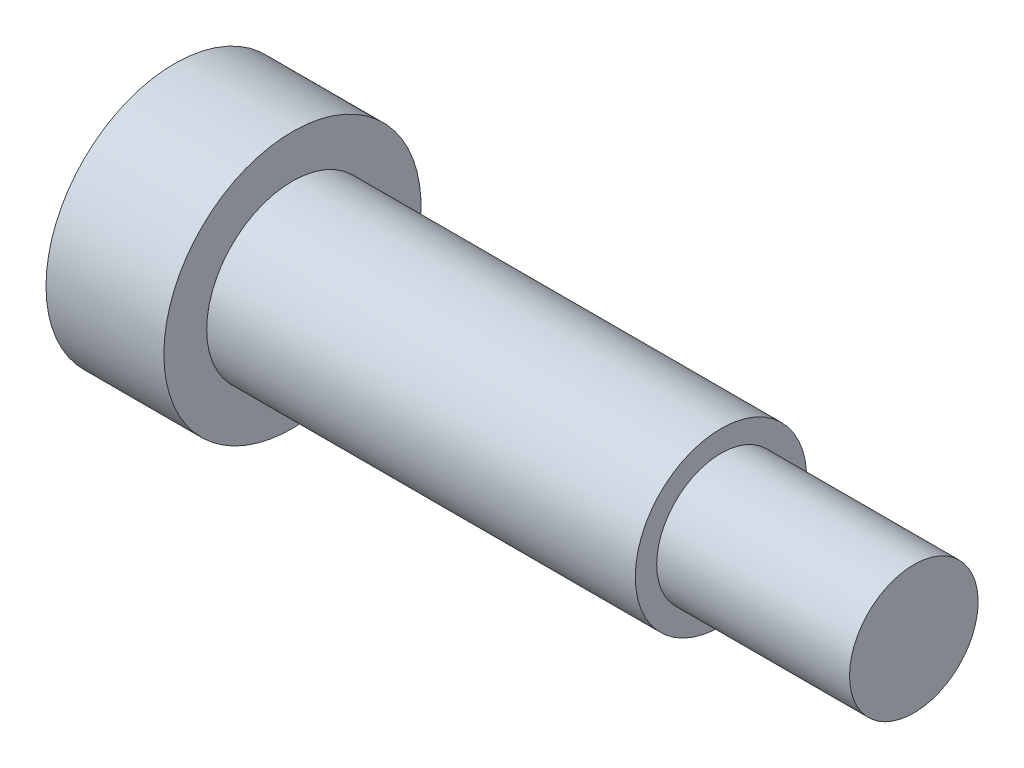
ISO-10303-21;
HEADER;
FILE_DESCRIPTION(('STEP AP214'),'2;1');
FILE_NAME('part.step','',(''),(''),'','','');
FILE_SCHEMA(('AUTOMOTIVE_DESIGN { 1 0 10303 214 1 1 1 1 }'));
ENDSEC;
DATA;
#1=APPLICATION_CONTEXT('core data for automotive mechanical design processes');
#2=APPLICATION_PROTOCOL_DEFINITION('international standard','automotive_design',2000,#1);
#3=PRODUCT_CONTEXT('',#1,'mechanical');
#4=PRODUCT('Part','Part','',(#3));
#5=PRODUCT_RELATED_PRODUCT_CATEGORY('part','',(#4));
#6=PRODUCT_DEFINITION_FORMATION('','',#4);
#7=PRODUCT_DEFINITION_CONTEXT('part definition',#1,'design');
#8=PRODUCT_DEFINITION('design','',#6,#7);
#9=PRODUCT_DEFINITION_SHAPE('','',#8);
#10=(LENGTH_UNIT() NAMED_UNIT(*) SI_UNIT(.MILLI.,.METRE.));
#11=(NAMED_UNIT(*) PLANE_ANGLE_UNIT() SI_UNIT($,.RADIAN.));
#12=(NAMED_UNIT(*) SI_UNIT($,.STERADIAN.) SOLID_ANGLE_UNIT());
#13=UNCERTAINTY_MEASURE_WITH_UNIT(LENGTH_MEASURE(1.E-05),#10,'distance_accuracy_value','');
#14=(GEOMETRIC_REPRESENTATION_CONTEXT(3) GLOBAL_UNCERTAINTY_ASSIGNED_CONTEXT((#13)) GLOBAL_UNIT_ASSIGNED_CONTEXT((#10,
#11,#12)) REPRESENTATION_CONTEXT('',''));
#15=CARTESIAN_POINT('',(0.,0.,0.));
#16=DIRECTION('',(0.,0.,1.));
#17=DIRECTION('',(1.,0.,0.));
#18=AXIS2_PLACEMENT_3D('',#15,#16,#17);
#19=CARTESIAN_POINT('',(-5.,0.,4.61880215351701));
#20=DIRECTION('',(-1.,0.,0.));
#21=DIRECTION('',(0.,0.,1.));
#22=AXIS2_PLACEMENT_3D('',#19,#20,#21);
#23=PLANE('',#22);
#24=DIRECTION('',(0.,0.866025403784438,-0.5));
#25=VECTOR('',#24,1.);
#26=CARTESIAN_POINT('',(-5.,0.,-4.61880215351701));
#27=LINE('',#26,#25);
#28=CARTESIAN_POINT('',(-5.,0.,-4.61880215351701));
#29=VERTEX_POINT('',#28);
#30=CARTESIAN_POINT('',(-5.,-4.,-2.3094010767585));
#31=VERTEX_POINT('',#30);
#32=EDGE_CURVE('E90',#29,#31,#27,.F.);
#33=ORIENTED_EDGE('',*,*,#32,.T.);
#34=DIRECTION('',(0.,0.,-1.));
#35=VECTOR('',#34,1.);
#36=CARTESIAN_POINT('',(-5.,-4.,-2.3094010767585));
#37=LINE('',#36,#35);
#38=CARTESIAN_POINT('',(-5.,-4.,2.3094010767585));
#39=VERTEX_POINT('',#38);
#40=EDGE_CURVE('E132',#31,#39,#37,.F.);
#41=ORIENTED_EDGE('',*,*,#40,.T.);
#42=DIRECTION('',(0.,-0.866025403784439,-0.5));
#43=VECTOR('',#42,1.);
#44=CARTESIAN_POINT('',(-5.,-4.,2.3094010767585));
#45=LINE('',#44,#43);
#46=CARTESIAN_POINT('',(-5.,0.,4.61880215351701));
#47=VERTEX_POINT('',#46);
#48=EDGE_CURVE('E127',#39,#47,#45,.F.);
#49=ORIENTED_EDGE('',*,*,#48,.T.);
#50=DIRECTION('',(0.,-0.866025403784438,0.5));
#51=VECTOR('',#50,1.);
#52=CARTESIAN_POINT('',(-5.,0.,4.61880215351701));
#53=LINE('',#52,#51);
#54=CARTESIAN_POINT('',(-5.,4.,2.3094010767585));
#55=VERTEX_POINT('',#54);
#56=EDGE_CURVE('E73',#47,#55,#53,.F.);
#57=ORIENTED_EDGE('',*,*,#56,.T.);
#58=DIRECTION('',(0.,0.,1.));
#59=VECTOR('',#58,1.);
#60=CARTESIAN_POINT('',(-5.,4.,2.3094010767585));
#61=LINE('',#60,#59);
#62=CARTESIAN_POINT('',(-5.,4.,-2.3094010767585));
#63=VERTEX_POINT('',#62);
#64=EDGE_CURVE('E70',#55,#63,#61,.F.);
#65=ORIENTED_EDGE('',*,*,#64,.T.);
#66=DIRECTION('',(0.,0.866025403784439,0.5));
#67=VECTOR('',#66,1.);
#68=CARTESIAN_POINT('',(-5.,4.,-2.3094010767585));
#69=LINE('',#68,#67);
#70=EDGE_CURVE('E67',#63,#29,#69,.F.);
#71=ORIENTED_EDGE('',*,*,#70,.T.);
#72=EDGE_LOOP('',(#33,#41,#49,#57,#65,#71));
#73=FACE_BOUND('',#72,.T.);
#74=ADVANCED_FACE('F16',(#73),#23,.T.);
#75=CARTESIAN_POINT('',(-5.,4.,2.3094010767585));
#76=DIRECTION('',(0.,1.,0.));
#77=DIRECTION('',(0.,0.,1.));
#78=AXIS2_PLACEMENT_3D('',#75,#76,#77);
#79=PLANE('',#78);
#80=DIRECTION('',(1.,0.,0.));
#81=VECTOR('',#80,1.);
#82=CARTESIAN_POINT('',(-5.,4.,-2.3094010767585));
#83=LINE('',#82,#81);
#84=CARTESIAN_POINT('',(-11.,4.,-2.3094010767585));
#85=VERTEX_POINT('',#84);
#86=EDGE_CURVE('E76',#85,#63,#83,.T.);
#87=ORIENTED_EDGE('',*,*,#86,.T.);
#88=ORIENTED_EDGE('',*,*,#64,.F.);
#89=DIRECTION('',(1.,0.,0.));
#90=VECTOR('',#89,1.);
#91=CARTESIAN_POINT('',(-5.,4.,2.3094010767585));
#92=LINE('',#91,#90);
#93=CARTESIAN_POINT('',(-11.,4.,2.3094010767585));
#94=VERTEX_POINT('',#93);
#95=EDGE_CURVE('E122',#55,#94,#92,.F.);
#96=ORIENTED_EDGE('',*,*,#95,.T.);
#97=DIRECTION('',(0.,0.,-1.));
#98=VECTOR('',#97,1.);
#99=CARTESIAN_POINT('',(-11.,4.,0.));
#100=LINE('',#99,#98);
#101=EDGE_CURVE('E81',#94,#85,#100,.T.);
#102=ORIENTED_EDGE('',*,*,#101,.T.);
#103=EDGE_LOOP('',(#87,#88,#96,#102));
#104=FACE_BOUND('',#103,.T.);
#105=ADVANCED_FACE('F79',(#104),#79,.F.);
#106=CARTESIAN_POINT('',(-5.,4.,-2.3094010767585));
#107=DIRECTION('',(0.,0.5,-0.866025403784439));
#108=DIRECTION('',(0.,0.866025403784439,0.5));
#109=AXIS2_PLACEMENT_3D('',#106,#107,#108);
#110=PLANE('',#109);
#111=DIRECTION('',(1.,0.,0.));
#112=VECTOR('',#111,1.);
#113=CARTESIAN_POINT('',(-5.,0.,-4.61880215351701));
#114=LINE('',#113,#112);
#115=CARTESIAN_POINT('',(-11.,0.,-4.61880215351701));
#116=VERTEX_POINT('',#115);
#117=EDGE_CURVE('E87',#116,#29,#114,.T.);
#118=ORIENTED_EDGE('',*,*,#117,.T.);
#119=ORIENTED_EDGE('',*,*,#70,.F.);
#120=ORIENTED_EDGE('',*,*,#86,.F.);
#121=DIRECTION('',(0.,-0.866025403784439,-0.5));
#122=VECTOR('',#121,1.);
#123=CARTESIAN_POINT('',(-11.,4.,-2.3094010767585));
#124=LINE('',#123,#122);
#125=EDGE_CURVE('E119',#85,#116,#124,.T.);
#126=ORIENTED_EDGE('',*,*,#125,.T.);
#127=EDGE_LOOP('',(#118,#119,#120,#126));
#128=FACE_BOUND('',#127,.T.);
#129=ADVANCED_FACE('F85',(#128),#110,.F.);
#130=CARTESIAN_POINT('',(-5.,0.,-4.61880215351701));
#131=DIRECTION('',(0.,-0.5,-0.866025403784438));
#132=DIRECTION('',(0.,0.866025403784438,-0.5));
#133=AXIS2_PLACEMENT_3D('',#130,#131,#132);
#134=PLANE('',#133);
#135=DIRECTION('',(1.,0.,0.));
#136=VECTOR('',#135,1.);
#137=CARTESIAN_POINT('',(-5.,-4.,-2.3094010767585));
#138=LINE('',#137,#136);
#139=CARTESIAN_POINT('',(-11.,-4.,-2.3094010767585));
#140=VERTEX_POINT('',#139);
#141=EDGE_CURVE('E134',#140,#31,#138,.T.);
#142=ORIENTED_EDGE('',*,*,#141,.T.);
#143=ORIENTED_EDGE('',*,*,#32,.F.);
#144=ORIENTED_EDGE('',*,*,#117,.F.);
#145=DIRECTION('',(0.,-0.866025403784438,0.5));
#146=VECTOR('',#145,1.);
#147=CARTESIAN_POINT('',(-11.,0.,-4.61880215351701));
#148=LINE('',#147,#146);
#149=EDGE_CURVE('E117',#116,#140,#148,.T.);
#150=ORIENTED_EDGE('',*,*,#149,.T.);
#151=EDGE_LOOP('',(#142,#143,#144,#150));
#152=FACE_BOUND('',#151,.T.);
#153=ADVANCED_FACE('F139',(#152),#134,.F.);
#154=CARTESIAN_POINT('',(-5.,-4.,-2.3094010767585));
#155=DIRECTION('',(0.,-1.,0.));
#156=DIRECTION('',(0.,0.,-1.));
#157=AXIS2_PLACEMENT_3D('',#154,#155,#156);
#158=PLANE('',#157);
#159=DIRECTION('',(1.,0.,0.));
#160=VECTOR('',#159,1.);
#161=CARTESIAN_POINT('',(-5.,-4.,2.3094010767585));
#162=LINE('',#161,#160);
#163=CARTESIAN_POINT('',(-11.,-4.,2.3094010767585));
#164=VERTEX_POINT('',#163);
#165=EDGE_CURVE('E129',#164,#39,#162,.T.);
#166=ORIENTED_EDGE('',*,*,#165,.T.);
#167=ORIENTED_EDGE('',*,*,#40,.F.);
#168=ORIENTED_EDGE('',*,*,#141,.F.);
#169=DIRECTION('',(0.,0.,-1.));
#170=VECTOR('',#169,1.);
#171=CARTESIAN_POINT('',(-11.,-4.,0.));
#172=LINE('',#171,#170);
#173=EDGE_CURVE('E113',#140,#164,#172,.F.);
#174=ORIENTED_EDGE('',*,*,#173,.T.);
#175=EDGE_LOOP('',(#166,#167,#168,#174));
#176=FACE_BOUND('',#175,.T.);
#177=ADVANCED_FACE('F143',(#176),#158,.F.);
#178=CARTESIAN_POINT('',(-5.,-4.,2.3094010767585));
#179=DIRECTION('',(0.,-0.5,0.866025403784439));
#180=DIRECTION('',(0.,-0.866025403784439,-0.5));
#181=AXIS2_PLACEMENT_3D('',#178,#179,#180);
#182=PLANE('',#181);
#183=DIRECTION('',(1.,0.,0.));
#184=VECTOR('',#183,1.);
#185=CARTESIAN_POINT('',(-5.,0.,4.61880215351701));
#186=LINE('',#185,#184);
#187=CARTESIAN_POINT('',(-11.,0.,4.61880215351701));
#188=VERTEX_POINT('',#187);
#189=EDGE_CURVE('E125',#188,#47,#186,.T.);
#190=ORIENTED_EDGE('',*,*,#189,.T.);
#191=ORIENTED_EDGE('',*,*,#48,.F.);
#192=ORIENTED_EDGE('',*,*,#165,.F.);
#193=DIRECTION('',(0.,0.866025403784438,0.5));
#194=VECTOR('',#193,1.);
#195=CARTESIAN_POINT('',(-11.,-4.,2.3094010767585));
#196=LINE('',#195,#194);
#197=EDGE_CURVE('E34',#164,#188,#196,.T.);
#198=ORIENTED_EDGE('',*,*,#197,.T.);
#199=EDGE_LOOP('',(#190,#191,#192,#198));
#200=FACE_BOUND('',#199,.T.);
#201=ADVANCED_FACE('F145',(#200),#182,.F.);
#202=CARTESIAN_POINT('',(-5.,0.,4.61880215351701));
#203=DIRECTION('',(0.,0.5,0.866025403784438));
#204=DIRECTION('',(0.,-0.866025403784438,0.5));
#205=AXIS2_PLACEMENT_3D('',#202,#203,#204);
#206=PLANE('',#205);
#207=ORIENTED_EDGE('',*,*,#95,.F.);
#208=ORIENTED_EDGE('',*,*,#56,.F.);
#209=ORIENTED_EDGE('',*,*,#189,.F.);
#210=DIRECTION('',(0.,0.866025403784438,-0.500000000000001));
#211=VECTOR('',#210,1.);
#212=CARTESIAN_POINT('',(-11.,0.,4.61880215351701));
#213=LINE('',#212,#211);
#214=EDGE_CURVE('E106',#188,#94,#213,.T.);
#215=ORIENTED_EDGE('',*,*,#214,.T.);
#216=EDGE_LOOP('',(#207,#208,#209,#215));
#217=FACE_BOUND('',#216,.T.);
#218=ADVANCED_FACE('F146',(#217),#206,.F.);
#219=CARTESIAN_POINT('',(58.,6.,0.));
#220=DIRECTION('',(-1.,0.,0.));
#221=DIRECTION('',(0.,0.,1.));
#222=AXIS2_PLACEMENT_3D('',#219,#220,#221);
#223=PLANE('',#222);
#224=CARTESIAN_POINT('',(58.,0.,0.));
#225=DIRECTION('',(-1.,0.,0.));
#226=DIRECTION('',(0.,0.,1.));
#227=AXIS2_PLACEMENT_3D('',#224,#225,#226);
#228=CIRCLE('',#227,6.);
#229=CARTESIAN_POINT('',(58.,0.,6.));
#230=VERTEX_POINT('',#229);
#231=EDGE_CURVE('E19',#230,#230,#228,.T.);
#232=ORIENTED_EDGE('',*,*,#231,.F.);
#233=EDGE_LOOP('',(#232));
#234=FACE_BOUND('',#233,.T.);
#235=ADVANCED_FACE('F148',(#234),#223,.F.);
#236=CARTESIAN_POINT('',(-11.,0.,0.));
#237=DIRECTION('',(1.,0.,0.));
#238=DIRECTION('',(0.,0.,-1.));
#239=AXIS2_PLACEMENT_3D('',#236,#237,#238);
#240=PLANE('',#239);
#241=CARTESIAN_POINT('',(-11.,0.,0.));
#242=DIRECTION('',(-1.,0.,0.));
#243=DIRECTION('',(0.,0.,1.));
#244=AXIS2_PLACEMENT_3D('',#241,#242,#243);
#245=CIRCLE('',#244,12.);
#246=CARTESIAN_POINT('',(-11.,0.,12.));
#247=VERTEX_POINT('',#246);
#248=EDGE_CURVE('E101',#247,#247,#245,.F.);
#249=ORIENTED_EDGE('',*,*,#248,.F.);
#250=EDGE_LOOP('',(#249));
#251=FACE_BOUND('',#250,.T.);
#252=ORIENTED_EDGE('',*,*,#197,.F.);
#253=ORIENTED_EDGE('',*,*,#173,.F.);
#254=ORIENTED_EDGE('',*,*,#149,.F.);
#255=ORIENTED_EDGE('',*,*,#125,.F.);
#256=ORIENTED_EDGE('',*,*,#101,.F.);
#257=ORIENTED_EDGE('',*,*,#214,.F.);
#258=EDGE_LOOP('',(#252,#253,#254,#255,#256,#257));
#259=FACE_BOUND('',#258,.T.);
#260=ADVANCED_FACE('F155',(#251,#259),#240,.F.);
#261=CARTESIAN_POINT('',(-34.3074265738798,0.,0.));
#262=DIRECTION('',(-1.,0.,0.));
#263=DIRECTION('',(0.,0.,1.));
#264=AXIS2_PLACEMENT_3D('',#261,#262,#263);
#265=CYLINDRICAL_SURFACE('',#264,6.);
#266=CARTESIAN_POINT('',(40.,0.,0.));
#267=DIRECTION('',(-1.,0.,0.));
#268=DIRECTION('',(0.,0.,1.));
#269=AXIS2_PLACEMENT_3D('',#266,#267,#268);
#270=CIRCLE('',#269,6.);
#271=CARTESIAN_POINT('',(40.,0.,6.));
#272=VERTEX_POINT('',#271);
#273=EDGE_CURVE('E99',#272,#272,#270,.F.);
#274=ORIENTED_EDGE('',*,*,#273,.T.);
#275=EDGE_LOOP('',(#274));
#276=FACE_BOUND('',#275,.T.);
#277=ORIENTED_EDGE('',*,*,#231,.T.);
#278=EDGE_LOOP('',(#277));
#279=FACE_BOUND('',#278,.T.);
#280=ADVANCED_FACE('F178',(#276,#279),#265,.T.);
#281=CARTESIAN_POINT('',(-34.3074265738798,0.,0.));
#282=DIRECTION('',(-1.,0.,0.));
#283=DIRECTION('',(0.,0.,1.));
#284=AXIS2_PLACEMENT_3D('',#281,#282,#283);
#285=CYLINDRICAL_SURFACE('',#284,12.);
#286=ORIENTED_EDGE('',*,*,#248,.T.);
#287=EDGE_LOOP('',(#286));
#288=FACE_BOUND('',#287,.T.);
#289=CARTESIAN_POINT('',(0.,0.,0.));
#290=DIRECTION('',(-1.,0.,0.));
#291=DIRECTION('',(0.,0.,1.));
#292=AXIS2_PLACEMENT_3D('',#289,#290,#291);
#293=CIRCLE('',#292,12.);
#294=CARTESIAN_POINT('',(0.,0.,12.));
#295=VERTEX_POINT('',#294);
#296=EDGE_CURVE('E96',#295,#295,#293,.T.);
#297=ORIENTED_EDGE('',*,*,#296,.T.);
#298=EDGE_LOOP('',(#297));
#299=FACE_BOUND('',#298,.T.);
#300=ADVANCED_FACE('F174',(#288,#299),#285,.T.);
#301=CARTESIAN_POINT('',(40.,8.,0.));
#302=DIRECTION('',(-1.,0.,0.));
#303=DIRECTION('',(0.,0.,1.));
#304=AXIS2_PLACEMENT_3D('',#301,#302,#303);
#305=PLANE('',#304);
#306=ORIENTED_EDGE('',*,*,#273,.F.);
#307=EDGE_LOOP('',(#306));
#308=FACE_BOUND('',#307,.T.);
#309=CARTESIAN_POINT('',(40.,0.,0.));
#310=DIRECTION('',(-1.,0.,0.));
#311=DIRECTION('',(0.,0.,1.));
#312=AXIS2_PLACEMENT_3D('',#309,#310,#311);
#313=CIRCLE('',#312,8.);
#314=CARTESIAN_POINT('',(40.,0.,8.));
#315=VERTEX_POINT('',#314);
#316=EDGE_CURVE('E25',#315,#315,#313,.T.);
#317=ORIENTED_EDGE('',*,*,#316,.F.);
#318=EDGE_LOOP('',(#317));
#319=FACE_BOUND('',#318,.T.);
#320=ADVANCED_FACE('F167',(#308,#319),#305,.F.);
#321=CARTESIAN_POINT('',(0.,12.,0.));
#322=DIRECTION('',(-1.,0.,0.));
#323=DIRECTION('',(0.,0.,1.));
#324=AXIS2_PLACEMENT_3D('',#321,#322,#323);
#325=PLANE('',#324);
#326=CARTESIAN_POINT('',(0.,0.,0.));
#327=DIRECTION('',(-1.,0.,0.));
#328=DIRECTION('',(0.,0.,1.));
#329=AXIS2_PLACEMENT_3D('',#326,#327,#328);
#330=CIRCLE('',#329,8.);
#331=CARTESIAN_POINT('',(0.,0.,8.));
#332=VERTEX_POINT('',#331);
#333=EDGE_CURVE('E11',#332,#332,#330,.F.);
#334=ORIENTED_EDGE('',*,*,#333,.F.);
#335=EDGE_LOOP('',(#334));
#336=FACE_BOUND('',#335,.T.);
#337=ORIENTED_EDGE('',*,*,#296,.F.);
#338=EDGE_LOOP('',(#337));
#339=FACE_BOUND('',#338,.T.);
#340=ADVANCED_FACE('F161',(#336,#339),#325,.F.);
#341=CARTESIAN_POINT('',(-34.3074265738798,0.,0.));
#342=DIRECTION('',(-1.,0.,0.));
#343=DIRECTION('',(0.,0.,1.));
#344=AXIS2_PLACEMENT_3D('',#341,#342,#343);
#345=CYLINDRICAL_SURFACE('',#344,8.);
#346=ORIENTED_EDGE('',*,*,#333,.T.);
#347=EDGE_LOOP('',(#346));
#348=FACE_BOUND('',#347,.T.);
#349=ORIENTED_EDGE('',*,*,#316,.T.);
#350=EDGE_LOOP('',(#349));
#351=FACE_BOUND('',#350,.T.);
#352=ADVANCED_FACE('F159',(#348,#351),#345,.T.);
#353=CLOSED_SHELL('',(#74,#105,#129,#153,#177,#201,#218,#235,#260,#280,#300,#320,#340,#352));
#354=MANIFOLD_SOLID_BREP('B1',#353);
#355=ADVANCED_BREP_SHAPE_REPRESENTATION('',(#18,#354),#14);
#356=SHAPE_DEFINITION_REPRESENTATION(#9,#355);
ENDSEC;
END-ISO-10303-21;
